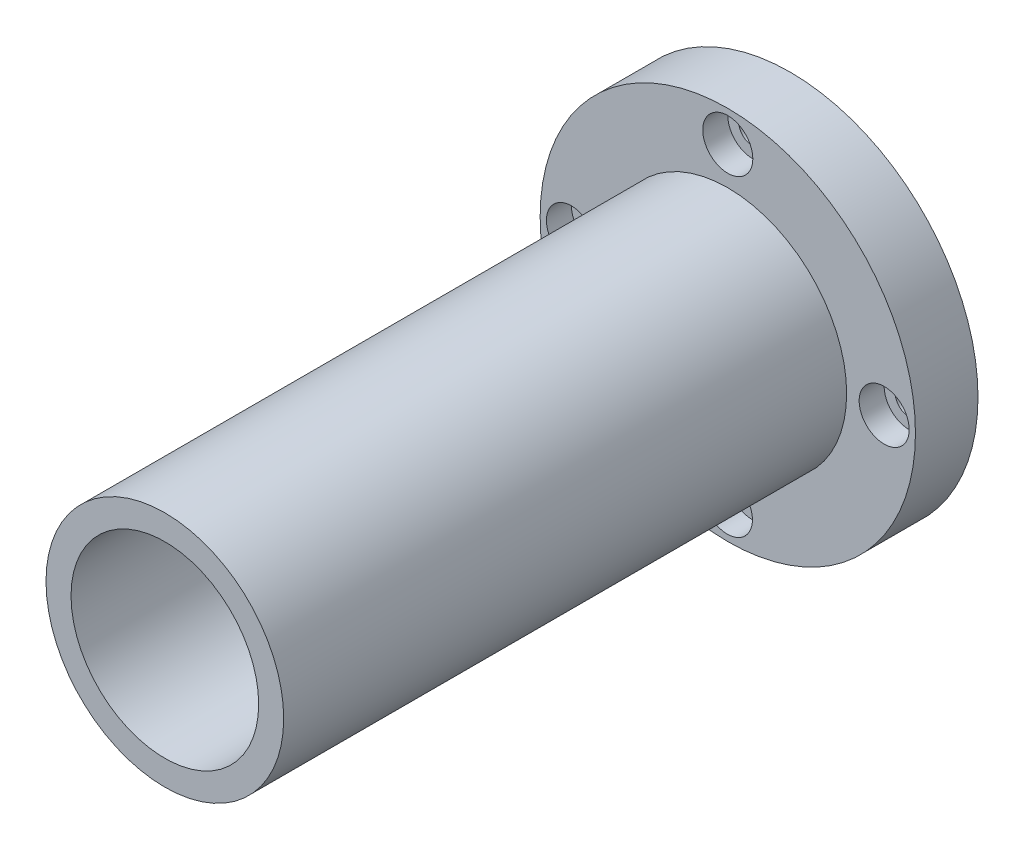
from build123d import *

# Parameters (mm, degrees)
SKETCH_1_R                   = 30
SKETCH_1_R_2                 = 15
EXTRUDE_1_DEPTH              = 10
SKETCH_2_R                   = 19
SKETCH_2_R_2                 = 15
EXTRUDE_2_DEPTH              = 90
HOLE_WIZARD_M4_1_D           = 4.5
HOLE_WIZARD_M4_1_CBORE_D     = 8
HOLE_WIZARD_M4_1_CBORE_DEPTH = 4


with BuildPart() as part:
    # Sketch 1 → Extrude 1 (new body)
    with BuildSketch(Plane.XY):
        Circle(SKETCH_1_R)
        Circle(SKETCH_1_R_2, mode=Mode.SUBTRACT)
    extrude(amount=EXTRUDE_1_DEPTH)

    # Sketch 2 → Extrude 2 (add)
    with BuildSketch(Plane.XY.offset(10)):
        with Locations(Location((0, 0, 0), (0, 0, 180))):
            Circle(SKETCH_2_R)
        Circle(SKETCH_2_R_2, mode=Mode.SUBTRACT)
    extrude(amount=EXTRUDE_2_DEPTH)

    # Hole Wizard M4 _1 (through all)
    with Locations(Plane.XY.offset(10)):
        with Locations((0, 25), (25, 0), (-0.063575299, -24.999919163), (-25, 0)):
            CounterBoreHole(HOLE_WIZARD_M4_1_D / 2, HOLE_WIZARD_M4_1_CBORE_D / 2, HOLE_WIZARD_M4_1_CBORE_DEPTH)


solid = part.part
